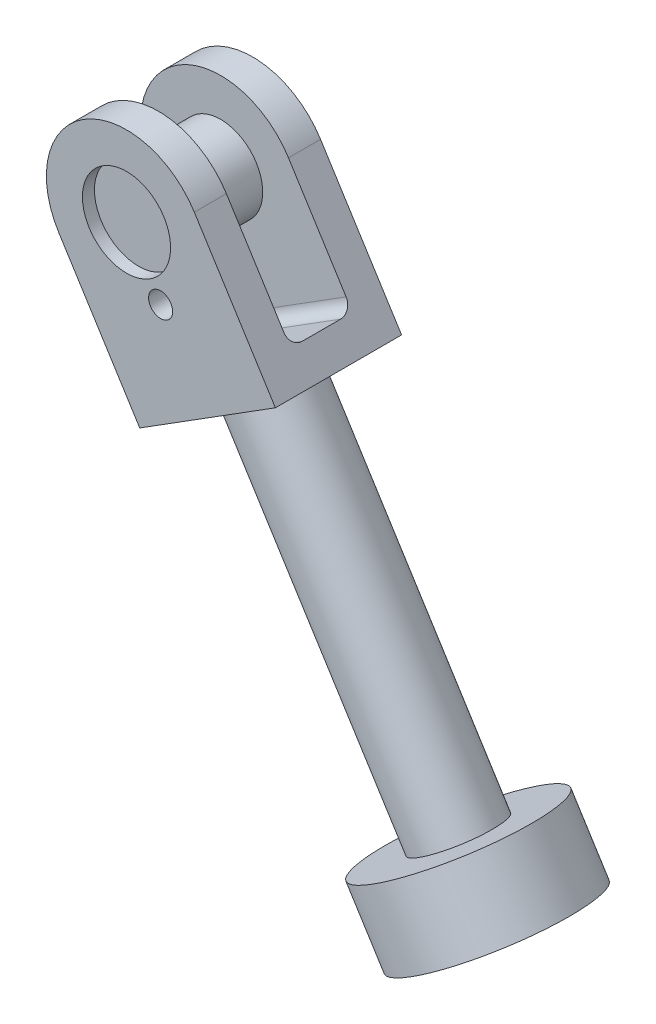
ISO-10303-21;
HEADER;
FILE_DESCRIPTION(('STEP AP214'),'2;1');
FILE_NAME('part.step','',(''),(''),'','','');
FILE_SCHEMA(('AUTOMOTIVE_DESIGN { 1 0 10303 214 1 1 1 1 }'));
ENDSEC;
DATA;
#1=APPLICATION_CONTEXT('core data for automotive mechanical design processes');
#2=APPLICATION_PROTOCOL_DEFINITION('international standard','automotive_design',2000,#1);
#3=PRODUCT_CONTEXT('',#1,'mechanical');
#4=PRODUCT('Part','Part','',(#3));
#5=PRODUCT_RELATED_PRODUCT_CATEGORY('part','',(#4));
#6=PRODUCT_DEFINITION_FORMATION('','',#4);
#7=PRODUCT_DEFINITION_CONTEXT('part definition',#1,'design');
#8=PRODUCT_DEFINITION('design','',#6,#7);
#9=PRODUCT_DEFINITION_SHAPE('','',#8);
#10=(LENGTH_UNIT() NAMED_UNIT(*) SI_UNIT(.MILLI.,.METRE.));
#11=(NAMED_UNIT(*) PLANE_ANGLE_UNIT() SI_UNIT($,.RADIAN.));
#12=(NAMED_UNIT(*) SI_UNIT($,.STERADIAN.) SOLID_ANGLE_UNIT());
#13=UNCERTAINTY_MEASURE_WITH_UNIT(LENGTH_MEASURE(1.E-05),#10,'distance_accuracy_value','');
#14=(GEOMETRIC_REPRESENTATION_CONTEXT(3) GLOBAL_UNCERTAINTY_ASSIGNED_CONTEXT((#13)) GLOBAL_UNIT_ASSIGNED_CONTEXT((#10,
#11,#12)) REPRESENTATION_CONTEXT('',''));
#15=CARTESIAN_POINT('',(0.,0.,0.));
#16=DIRECTION('',(0.,0.,1.));
#17=DIRECTION('',(1.,0.,0.));
#18=AXIS2_PLACEMENT_3D('',#15,#16,#17);
#19=CARTESIAN_POINT('',(-86.,190.5,21.5));
#20=DIRECTION('',(0.,0.,-1.));
#21=DIRECTION('',(-1.,0.,0.));
#22=AXIS2_PLACEMENT_3D('',#19,#20,#21);
#23=CYLINDRICAL_SURFACE('',#22,11.);
#24=CARTESIAN_POINT('',(-86.,190.5,15.75));
#25=DIRECTION('',(0.,0.,1.));
#26=DIRECTION('',(1.,0.,0.));
#27=AXIS2_PLACEMENT_3D('',#24,#25,#26);
#28=CIRCLE('',#27,11.);
#29=CARTESIAN_POINT('',(-97.,190.5,15.75));
#30=VERTEX_POINT('',#29);
#31=EDGE_CURVE('E318',#30,#30,#28,.T.);
#32=CARTESIAN_POINT('',(-86.,190.5,12.75));
#33=DIRECTION('',(0.,0.,-1.));
#34=DIRECTION('',(-1.,0.,0.));
#35=AXIS2_PLACEMENT_3D('',#32,#33,#34);
#36=CIRCLE('',#35,11.);
#37=CARTESIAN_POINT('',(-97.,190.5,12.75));
#38=VERTEX_POINT('',#37);
#39=EDGE_CURVE('E11',#38,#38,#36,.F.);
#40=CARTESIAN_POINT('',(-97.,190.5,15.75));
#41=CARTESIAN_POINT('',(-97.,190.5,15.71875));
#42=CARTESIAN_POINT('',(-97.,190.5,15.6875));
#43=CARTESIAN_POINT('',(-97.,190.5,15.625));
#44=CARTESIAN_POINT('',(-97.,190.5,15.59375));
#45=CARTESIAN_POINT('',(-97.,190.5,15.53125));
#46=CARTESIAN_POINT('',(-97.,190.5,15.5));
#47=CARTESIAN_POINT('',(-97.,190.5,15.4375));
#48=CARTESIAN_POINT('',(-97.,190.5,15.40625));
#49=CARTESIAN_POINT('',(-97.,190.5,15.34375));
#50=CARTESIAN_POINT('',(-97.,190.5,15.3125));
#51=CARTESIAN_POINT('',(-97.,190.5,15.25));
#52=CARTESIAN_POINT('',(-97.,190.5,15.21875));
#53=CARTESIAN_POINT('',(-97.,190.5,15.15625));
#54=CARTESIAN_POINT('',(-97.,190.5,15.125));
#55=CARTESIAN_POINT('',(-97.,190.5,15.0625));
#56=CARTESIAN_POINT('',(-97.,190.5,15.03125));
#57=CARTESIAN_POINT('',(-97.,190.5,14.96875));
#58=CARTESIAN_POINT('',(-97.,190.5,14.9375));
#59=CARTESIAN_POINT('',(-97.,190.5,14.875));
#60=CARTESIAN_POINT('',(-97.,190.5,14.84375));
#61=CARTESIAN_POINT('',(-97.,190.5,14.78125));
#62=CARTESIAN_POINT('',(-97.,190.5,14.75));
#63=CARTESIAN_POINT('',(-97.,190.5,14.6875));
#64=CARTESIAN_POINT('',(-97.,190.5,14.65625));
#65=CARTESIAN_POINT('',(-97.,190.5,14.59375));
#66=CARTESIAN_POINT('',(-97.,190.5,14.5625));
#67=CARTESIAN_POINT('',(-97.,190.5,14.5));
#68=CARTESIAN_POINT('',(-97.,190.5,14.46875));
#69=CARTESIAN_POINT('',(-97.,190.5,14.40625));
#70=CARTESIAN_POINT('',(-97.,190.5,14.375));
#71=CARTESIAN_POINT('',(-97.,190.5,14.3125));
#72=CARTESIAN_POINT('',(-97.,190.5,14.28125));
#73=CARTESIAN_POINT('',(-97.,190.5,14.21875));
#74=CARTESIAN_POINT('',(-97.,190.5,14.1875));
#75=CARTESIAN_POINT('',(-97.,190.5,14.125));
#76=CARTESIAN_POINT('',(-97.,190.5,14.09375));
#77=CARTESIAN_POINT('',(-97.,190.5,14.03125));
#78=CARTESIAN_POINT('',(-97.,190.5,14.));
#79=CARTESIAN_POINT('',(-97.,190.5,13.9375));
#80=CARTESIAN_POINT('',(-97.,190.5,13.90625));
#81=CARTESIAN_POINT('',(-97.,190.5,13.84375));
#82=CARTESIAN_POINT('',(-97.,190.5,13.8125));
#83=CARTESIAN_POINT('',(-97.,190.5,13.75));
#84=CARTESIAN_POINT('',(-97.,190.5,13.71875));
#85=CARTESIAN_POINT('',(-97.,190.5,13.65625));
#86=CARTESIAN_POINT('',(-97.,190.5,13.625));
#87=CARTESIAN_POINT('',(-97.,190.5,13.5625));
#88=CARTESIAN_POINT('',(-97.,190.5,13.53125));
#89=CARTESIAN_POINT('',(-97.,190.5,13.46875));
#90=CARTESIAN_POINT('',(-97.,190.5,13.4375));
#91=CARTESIAN_POINT('',(-97.,190.5,13.375));
#92=CARTESIAN_POINT('',(-97.,190.5,13.34375));
#93=CARTESIAN_POINT('',(-97.,190.5,13.28125));
#94=CARTESIAN_POINT('',(-97.,190.5,13.25));
#95=CARTESIAN_POINT('',(-97.,190.5,13.1875));
#96=CARTESIAN_POINT('',(-97.,190.5,13.15625));
#97=CARTESIAN_POINT('',(-97.,190.5,13.09375));
#98=CARTESIAN_POINT('',(-97.,190.5,13.0625));
#99=CARTESIAN_POINT('',(-97.,190.5,13.));
#100=CARTESIAN_POINT('',(-97.,190.5,12.96875));
#101=CARTESIAN_POINT('',(-97.,190.5,12.90625));
#102=CARTESIAN_POINT('',(-97.,190.5,12.875));
#103=CARTESIAN_POINT('',(-97.,190.5,12.8125));
#104=CARTESIAN_POINT('',(-97.,190.5,12.78125));
#105=CARTESIAN_POINT('',(-97.,190.5,12.75));
#106=B_SPLINE_CURVE_WITH_KNOTS('',3,(#40,#41,#42,#43,#44,#45,#46,#47,#48,#49,#50,#51,#52,#53,
#54,#55,#56,#57,#58,#59,#60,#61,#62,#63,#64,#65,#66,#67,#68,#69,#70,#71,#72,#73,#74,#75,#76,#77,
#78,#79,#80,#81,#82,#83,#84,#85,#86,#87,#88,#89,#90,#91,#92,#93,#94,#95,#96,#97,#98,#99,#100,
#101,#102,#103,#104,#105),.UNSPECIFIED.,.F.,.F.,(4,2,2,2,2,2,2,2,2,2,2,2,2,2,2,2,2,2,2,2,2,2,2,
2,2,2,2,2,2,2,2,2,4),(0.,0.0937500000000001,0.1875,0.281249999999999,0.374999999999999,
0.468749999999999,0.562499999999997,0.656249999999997,0.749999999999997,0.843749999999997,
0.937499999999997,1.03125,1.125,1.21875,1.3125,1.40625,1.5,1.59375,1.6875,1.78125,1.875,1.96875,
2.06249999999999,2.15625,2.25,2.34375,2.4375,2.53124999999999,2.62499999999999,2.71874999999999,
2.81249999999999,2.90624999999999,2.99999999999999),.UNSPECIFIED.);
#107=EDGE_CURVE('BSEAM36',#30,#38,#106,.T.);
#108=ORIENTED_EDGE('',*,*,#31,.T.);
#109=ORIENTED_EDGE('',*,*,#39,.F.);
#110=ORIENTED_EDGE('',*,*,#107,.T.);
#111=ORIENTED_EDGE('',*,*,#107,.F.);
#112=EDGE_LOOP('',(#108,#110,#109,#111));
#113=FACE_BOUND('',#112,.T.);
#114=ADVANCED_FACE('F36',(#113),#23,.F.);
#115=CARTESIAN_POINT('',(-86.,190.5,-15.75));
#116=DIRECTION('',(0.,0.,-1.));
#117=DIRECTION('',(-1.,0.,0.));
#118=AXIS2_PLACEMENT_3D('',#115,#116,#117);
#119=CIRCLE('',#118,11.);
#120=CARTESIAN_POINT('',(-97.,190.5,-15.75));
#121=VERTEX_POINT('',#120);
#122=EDGE_CURVE('E155',#121,#121,#119,.T.);
#123=CARTESIAN_POINT('',(-86.,190.5,-12.75));
#124=DIRECTION('',(0.,0.,1.));
#125=DIRECTION('',(1.,0.,0.));
#126=AXIS2_PLACEMENT_3D('',#123,#124,#125);
#127=CIRCLE('',#126,11.);
#128=CARTESIAN_POINT('',(-97.,190.5,-12.75));
#129=VERTEX_POINT('',#128);
#130=EDGE_CURVE('E44',#129,#129,#127,.F.);
#131=CARTESIAN_POINT('',(-97.,190.5,-15.75));
#132=CARTESIAN_POINT('',(-97.,190.5,-15.71875));
#133=CARTESIAN_POINT('',(-97.,190.5,-15.6875));
#134=CARTESIAN_POINT('',(-97.,190.5,-15.625));
#135=CARTESIAN_POINT('',(-97.,190.5,-15.59375));
#136=CARTESIAN_POINT('',(-97.,190.5,-15.53125));
#137=CARTESIAN_POINT('',(-97.,190.5,-15.5));
#138=CARTESIAN_POINT('',(-97.,190.5,-15.4375));
#139=CARTESIAN_POINT('',(-97.,190.5,-15.40625));
#140=CARTESIAN_POINT('',(-97.,190.5,-15.34375));
#141=CARTESIAN_POINT('',(-97.,190.5,-15.3125));
#142=CARTESIAN_POINT('',(-97.,190.5,-15.25));
#143=CARTESIAN_POINT('',(-97.,190.5,-15.21875));
#144=CARTESIAN_POINT('',(-97.,190.5,-15.15625));
#145=CARTESIAN_POINT('',(-97.,190.5,-15.125));
#146=CARTESIAN_POINT('',(-97.,190.5,-15.0625));
#147=CARTESIAN_POINT('',(-97.,190.5,-15.03125));
#148=CARTESIAN_POINT('',(-97.,190.5,-14.96875));
#149=CARTESIAN_POINT('',(-97.,190.5,-14.9375));
#150=CARTESIAN_POINT('',(-97.,190.5,-14.875));
#151=CARTESIAN_POINT('',(-97.,190.5,-14.84375));
#152=CARTESIAN_POINT('',(-97.,190.5,-14.78125));
#153=CARTESIAN_POINT('',(-97.,190.5,-14.75));
#154=CARTESIAN_POINT('',(-97.,190.5,-14.6875));
#155=CARTESIAN_POINT('',(-97.,190.5,-14.65625));
#156=CARTESIAN_POINT('',(-97.,190.5,-14.59375));
#157=CARTESIAN_POINT('',(-97.,190.5,-14.5625));
#158=CARTESIAN_POINT('',(-97.,190.5,-14.5));
#159=CARTESIAN_POINT('',(-97.,190.5,-14.46875));
#160=CARTESIAN_POINT('',(-97.,190.5,-14.40625));
#161=CARTESIAN_POINT('',(-97.,190.5,-14.375));
#162=CARTESIAN_POINT('',(-97.,190.5,-14.3125));
#163=CARTESIAN_POINT('',(-97.,190.5,-14.28125));
#164=CARTESIAN_POINT('',(-97.,190.5,-14.21875));
#165=CARTESIAN_POINT('',(-97.,190.5,-14.1875));
#166=CARTESIAN_POINT('',(-97.,190.5,-14.125));
#167=CARTESIAN_POINT('',(-97.,190.5,-14.09375));
#168=CARTESIAN_POINT('',(-97.,190.5,-14.03125));
#169=CARTESIAN_POINT('',(-97.,190.5,-14.));
#170=CARTESIAN_POINT('',(-97.,190.5,-13.9375));
#171=CARTESIAN_POINT('',(-97.,190.5,-13.90625));
#172=CARTESIAN_POINT('',(-97.,190.5,-13.84375));
#173=CARTESIAN_POINT('',(-97.,190.5,-13.8125));
#174=CARTESIAN_POINT('',(-97.,190.5,-13.75));
#175=CARTESIAN_POINT('',(-97.,190.5,-13.71875));
#176=CARTESIAN_POINT('',(-97.,190.5,-13.65625));
#177=CARTESIAN_POINT('',(-97.,190.5,-13.625));
#178=CARTESIAN_POINT('',(-97.,190.5,-13.5625));
#179=CARTESIAN_POINT('',(-97.,190.5,-13.53125));
#180=CARTESIAN_POINT('',(-97.,190.5,-13.46875));
#181=CARTESIAN_POINT('',(-97.,190.5,-13.4375));
#182=CARTESIAN_POINT('',(-97.,190.5,-13.375));
#183=CARTESIAN_POINT('',(-97.,190.5,-13.34375));
#184=CARTESIAN_POINT('',(-97.,190.5,-13.28125));
#185=CARTESIAN_POINT('',(-97.,190.5,-13.25));
#186=CARTESIAN_POINT('',(-97.,190.5,-13.1875));
#187=CARTESIAN_POINT('',(-97.,190.5,-13.15625));
#188=CARTESIAN_POINT('',(-97.,190.5,-13.09375));
#189=CARTESIAN_POINT('',(-97.,190.5,-13.0625));
#190=CARTESIAN_POINT('',(-97.,190.5,-13.));
#191=CARTESIAN_POINT('',(-97.,190.5,-12.96875));
#192=CARTESIAN_POINT('',(-97.,190.5,-12.90625));
#193=CARTESIAN_POINT('',(-97.,190.5,-12.875));
#194=CARTESIAN_POINT('',(-97.,190.5,-12.8125));
#195=CARTESIAN_POINT('',(-97.,190.5,-12.78125));
#196=CARTESIAN_POINT('',(-97.,190.5,-12.75));
#197=B_SPLINE_CURVE_WITH_KNOTS('',3,(#131,#132,#133,#134,#135,#136,#137,#138,#139,#140,#141,
#142,#143,#144,#145,#146,#147,#148,#149,#150,#151,#152,#153,#154,#155,#156,#157,#158,#159,#160,
#161,#162,#163,#164,#165,#166,#167,#168,#169,#170,#171,#172,#173,#174,#175,#176,#177,#178,#179,
#180,#181,#182,#183,#184,#185,#186,#187,#188,#189,#190,#191,#192,#193,#194,#195,#196),
.UNSPECIFIED.,.F.,.F.,(4,2,2,2,2,2,2,2,2,2,2,2,2,2,2,2,2,2,2,2,2,2,2,2,2,2,2,2,2,2,2,2,4),(0.,
0.0937499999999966,0.1875,0.281249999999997,0.375,0.468749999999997,0.5625,0.656249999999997,
0.750000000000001,0.843749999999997,0.937499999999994,1.03125,1.12499999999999,1.21875,
1.31249999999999,1.40625,1.49999999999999,1.59374999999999,1.68749999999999,1.78124999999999,
1.87499999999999,1.96874999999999,2.06249999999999,2.15624999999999,2.24999999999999,
2.34374999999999,2.43749999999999,2.53124999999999,2.62499999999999,2.71874999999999,
2.81249999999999,2.90624999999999,2.99999999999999),.UNSPECIFIED.);
#198=EDGE_CURVE('BSEAM214',#121,#129,#197,.T.);
#199=ORIENTED_EDGE('',*,*,#122,.T.);
#200=ORIENTED_EDGE('',*,*,#130,.F.);
#201=ORIENTED_EDGE('',*,*,#198,.T.);
#202=ORIENTED_EDGE('',*,*,#198,.F.);
#203=EDGE_LOOP('',(#199,#201,#200,#202));
#204=FACE_BOUND('',#203,.T.);
#205=ADVANCED_FACE('F214',(#204),#23,.F.);
#206=CARTESIAN_POINT('',(-18.9268808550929,83.8360572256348,0.));
#207=DIRECTION('',(0.532326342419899,-0.846539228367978,0.));
#208=DIRECTION('',(0.846539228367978,0.532326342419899,0.));
#209=AXIS2_PLACEMENT_3D('',#206,#207,#208);
#210=CYLINDRICAL_SURFACE('',#209,21.5);
#211=CARTESIAN_POINT('',(-18.9268808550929,83.8360572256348,0.));
#212=DIRECTION('',(0.532326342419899,-0.846539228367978,0.));
#213=DIRECTION('',(0.846539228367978,0.532326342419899,0.));
#214=AXIS2_PLACEMENT_3D('',#211,#212,#213);
#215=CIRCLE('',#214,21.5);
#216=CARTESIAN_POINT('',(-0.726287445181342,95.2810735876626,0.));
#217=VERTEX_POINT('',#216);
#218=EDGE_CURVE('E189',#217,#217,#215,.T.);
#219=ORIENTED_EDGE('',*,*,#218,.T.);
#220=EDGE_LOOP('',(#219));
#221=FACE_BOUND('',#220,.T.);
#222=CARTESIAN_POINT('',(-9.3450066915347,68.5983511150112,0.));
#223=DIRECTION('',(0.532326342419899,-0.846539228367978,0.));
#224=DIRECTION('',(0.846539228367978,0.532326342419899,0.));
#225=AXIS2_PLACEMENT_3D('',#222,#223,#224);
#226=CIRCLE('',#225,21.5);
#227=CARTESIAN_POINT('',(8.85558671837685,80.043367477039,0.));
#228=VERTEX_POINT('',#227);
#229=EDGE_CURVE('E186',#228,#228,#226,.T.);
#230=ORIENTED_EDGE('',*,*,#229,.F.);
#231=EDGE_LOOP('',(#230));
#232=FACE_BOUND('',#231,.T.);
#233=ADVANCED_FACE('F216',(#221,#232),#210,.T.);
#234=CARTESIAN_POINT('',(-18.9268808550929,83.8360572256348,0.));
#235=DIRECTION('',(0.532326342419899,-0.846539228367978,0.));
#236=DIRECTION('',(0.846539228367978,0.532326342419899,0.));
#237=AXIS2_PLACEMENT_3D('',#234,#235,#236);
#238=PLANE('',#237);
#239=CARTESIAN_POINT('',(-18.9268808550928,83.8360572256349,0.));
#240=DIRECTION('',(0.532326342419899,-0.846539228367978,0.));
#241=DIRECTION('',(0.846539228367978,0.532326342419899,0.));
#242=AXIS2_PLACEMENT_3D('',#239,#240,#241);
#243=CIRCLE('',#242,10.);
#244=CARTESIAN_POINT('',(-10.461488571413,89.1593206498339,0.));
#245=VERTEX_POINT('',#244);
#246=EDGE_CURVE('E192',#245,#245,#243,.F.);
#247=ORIENTED_EDGE('',*,*,#246,.F.);
#248=EDGE_LOOP('',(#247));
#249=FACE_BOUND('',#248,.T.);
#250=ORIENTED_EDGE('',*,*,#218,.F.);
#251=EDGE_LOOP('',(#250));
#252=FACE_BOUND('',#251,.T.);
#253=ADVANCED_FACE('F223',(#249,#252),#238,.F.);
#254=CARTESIAN_POINT('',(-9.3450066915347,68.5983511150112,0.));
#255=DIRECTION('',(0.532326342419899,-0.846539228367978,0.));
#256=DIRECTION('',(0.846539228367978,0.532326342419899,0.));
#257=AXIS2_PLACEMENT_3D('',#254,#255,#256);
#258=PLANE('',#257);
#259=ORIENTED_EDGE('',*,*,#229,.T.);
#260=EDGE_LOOP('',(#259));
#261=FACE_BOUND('',#260,.T.);
#262=ADVANCED_FACE('F236',(#261),#258,.T.);
#263=CARTESIAN_POINT('',(-12.538964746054,73.6775864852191,0.));
#264=DIRECTION('',(-0.532326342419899,0.846539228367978,0.));
#265=DIRECTION('',(-0.846539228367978,-0.532326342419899,0.));
#266=AXIS2_PLACEMENT_3D('',#263,#264,#265);
#267=CYLINDRICAL_SURFACE('',#266,10.);
#268=CARTESIAN_POINT('',(-65.7715989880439,158.331509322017,0.));
#269=DIRECTION('',(0.532326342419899,-0.846539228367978,0.));
#270=DIRECTION('',(0.846539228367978,0.532326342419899,0.));
#271=AXIS2_PLACEMENT_3D('',#268,#269,#270);
#272=CIRCLE('',#271,10.);
#273=CARTESIAN_POINT('',(-57.3062067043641,163.654772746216,0.));
#274=VERTEX_POINT('',#273);
#275=EDGE_CURVE('E148',#274,#274,#272,.T.);
#276=ORIENTED_EDGE('',*,*,#275,.T.);
#277=EDGE_LOOP('',(#276));
#278=FACE_BOUND('',#277,.T.);
#279=ORIENTED_EDGE('',*,*,#246,.T.);
#280=EDGE_LOOP('',(#279));
#281=FACE_BOUND('',#280,.T.);
#282=ADVANCED_FACE('F232',(#278,#281),#267,.T.);
#283=CARTESIAN_POINT('',(-86.,190.5,-15.75));
#284=DIRECTION('',(0.,0.,1.));
#285=DIRECTION('',(1.,0.,0.));
#286=AXIS2_PLACEMENT_3D('',#283,#284,#285);
#287=CYLINDRICAL_SURFACE('',#286,20.);
#288=CARTESIAN_POINT('',(-86.,190.5,-7.75));
#289=DIRECTION('',(0.,0.,-1.));
#290=DIRECTION('',(-1.,0.,0.));
#291=AXIS2_PLACEMENT_3D('',#288,#289,#290);
#292=CIRCLE('',#291,20.);
#293=CARTESIAN_POINT('',(-102.93078456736,179.853473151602,-7.75));
#294=VERTEX_POINT('',#293);
#295=CARTESIAN_POINT('',(-69.0692154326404,201.146526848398,-7.75));
#296=VERTEX_POINT('',#295);
#297=EDGE_CURVE('E178',#294,#296,#292,.T.);
#298=ORIENTED_EDGE('',*,*,#297,.T.);
#299=DIRECTION('',(0.,0.,1.));
#300=VECTOR('',#299,1.);
#301=CARTESIAN_POINT('',(-69.0692154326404,201.146526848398,-15.75));
#302=LINE('',#301,#300);
#303=CARTESIAN_POINT('',(-69.0692154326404,201.146526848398,-15.75));
#304=VERTEX_POINT('',#303);
#305=EDGE_CURVE('E176',#304,#296,#302,.T.);
#306=ORIENTED_EDGE('',*,*,#305,.F.);
#307=CARTESIAN_POINT('',(-86.,190.5,-15.75));
#308=DIRECTION('',(0.,0.,-1.));
#309=DIRECTION('',(-1.,0.,0.));
#310=AXIS2_PLACEMENT_3D('',#307,#308,#309);
#311=CIRCLE('',#310,20.);
#312=CARTESIAN_POINT('',(-102.93078456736,179.853473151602,-15.75));
#313=VERTEX_POINT('',#312);
#314=EDGE_CURVE('E171',#313,#304,#311,.T.);
#315=ORIENTED_EDGE('',*,*,#314,.F.);
#316=DIRECTION('',(0.,0.,1.));
#317=VECTOR('',#316,1.);
#318=CARTESIAN_POINT('',(-102.93078456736,179.853473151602,-15.75));
#319=LINE('',#318,#317);
#320=EDGE_CURVE('E183',#313,#294,#319,.T.);
#321=ORIENTED_EDGE('',*,*,#320,.T.);
#322=EDGE_LOOP('',(#298,#306,#315,#321));
#323=FACE_BOUND('',#322,.T.);
#324=ADVANCED_FACE('F235',(#323),#287,.T.);
#325=CARTESIAN_POINT('',(-86.,190.5,15.75));
#326=DIRECTION('',(0.,0.,-1.));
#327=DIRECTION('',(-1.,0.,0.));
#328=AXIS2_PLACEMENT_3D('',#325,#326,#327);
#329=CYLINDRICAL_SURFACE('',#328,20.);
#330=CARTESIAN_POINT('',(-86.,190.5,7.75));
#331=DIRECTION('',(0.,0.,1.));
#332=DIRECTION('',(1.,0.,0.));
#333=AXIS2_PLACEMENT_3D('',#330,#331,#332);
#334=CIRCLE('',#333,20.);
#335=CARTESIAN_POINT('',(-69.0692154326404,201.146526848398,7.75));
#336=VERTEX_POINT('',#335);
#337=CARTESIAN_POINT('',(-102.93078456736,179.853473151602,7.75));
#338=VERTEX_POINT('',#337);
#339=EDGE_CURVE('E161',#336,#338,#334,.T.);
#340=ORIENTED_EDGE('',*,*,#339,.T.);
#341=DIRECTION('',(0.,0.,-1.));
#342=VECTOR('',#341,1.);
#343=CARTESIAN_POINT('',(-102.93078456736,179.853473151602,15.75));
#344=LINE('',#343,#342);
#345=CARTESIAN_POINT('',(-102.93078456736,179.853473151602,15.75));
#346=VERTEX_POINT('',#345);
#347=EDGE_CURVE('E159',#346,#338,#344,.T.);
#348=ORIENTED_EDGE('',*,*,#347,.F.);
#349=CARTESIAN_POINT('',(-86.,190.5,15.75));
#350=DIRECTION('',(0.,0.,1.));
#351=DIRECTION('',(1.,0.,0.));
#352=AXIS2_PLACEMENT_3D('',#349,#350,#351);
#353=CIRCLE('',#352,20.);
#354=CARTESIAN_POINT('',(-69.0692154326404,201.146526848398,15.75));
#355=VERTEX_POINT('',#354);
#356=EDGE_CURVE('E126',#355,#346,#353,.T.);
#357=ORIENTED_EDGE('',*,*,#356,.F.);
#358=DIRECTION('',(0.,0.,-1.));
#359=VECTOR('',#358,1.);
#360=CARTESIAN_POINT('',(-69.0692154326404,201.146526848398,15.75));
#361=LINE('',#360,#359);
#362=EDGE_CURVE('E123',#355,#336,#361,.T.);
#363=ORIENTED_EDGE('',*,*,#362,.T.);
#364=EDGE_LOOP('',(#340,#348,#357,#363));
#365=FACE_BOUND('',#364,.T.);
#366=ADVANCED_FACE('F253',(#365),#329,.T.);
#367=CARTESIAN_POINT('',(30.0521732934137,5.94644816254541,-15.75));
#368=DIRECTION('',(0.,0.,-1.));
#369=DIRECTION('',(-1.,0.,0.));
#370=AXIS2_PLACEMENT_3D('',#367,#368,#369);
#371=PLANE('',#370);
#372=ORIENTED_EDGE('',*,*,#122,.F.);
#373=EDGE_LOOP('',(#372));
#374=FACE_BOUND('',#373,.T.);
#375=DIRECTION('',(0.532326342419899,-0.846539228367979,0.));
#376=VECTOR('',#375,1.);
#377=CARTESIAN_POINT('',(46.9829578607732,16.5929750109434,-15.75));
#378=LINE('',#377,#376);
#379=CARTESIAN_POINT('',(-48.8408144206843,168.978036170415,-15.75));
#380=VERTEX_POINT('',#379);
#381=EDGE_CURVE('E174',#304,#380,#378,.T.);
#382=ORIENTED_EDGE('',*,*,#381,.T.);
#383=DIRECTION('',(0.846539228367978,0.532326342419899,0.));
#384=VECTOR('',#383,1.);
#385=CARTESIAN_POINT('',(-48.8408144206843,168.978036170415,-15.75));
#386=LINE('',#385,#384);
#387=CARTESIAN_POINT('',(-82.7023835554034,147.684982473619,-15.75));
#388=VERTEX_POINT('',#387);
#389=EDGE_CURVE('E142',#388,#380,#386,.T.);
#390=ORIENTED_EDGE('',*,*,#389,.F.);
#391=DIRECTION('',(-0.532326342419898,0.846539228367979,0.));
#392=VECTOR('',#391,1.);
#393=CARTESIAN_POINT('',(13.1213887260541,-4.70007868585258,-15.75));
#394=LINE('',#393,#392);
#395=EDGE_CURVE('E169',#388,#313,#394,.T.);
#396=ORIENTED_EDGE('',*,*,#395,.T.);
#397=ORIENTED_EDGE('',*,*,#314,.T.);
#398=EDGE_LOOP('',(#382,#390,#396,#397));
#399=FACE_BOUND('',#398,.T.);
#400=ADVANCED_FACE('F256',(#374,#399),#371,.T.);
#401=CARTESIAN_POINT('',(30.0521732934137,5.94644816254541,-7.75));
#402=DIRECTION('',(0.,0.,-1.));
#403=DIRECTION('',(-1.,0.,0.));
#404=AXIS2_PLACEMENT_3D('',#401,#402,#403);
#405=PLANE('',#404);
#406=DIRECTION('',(-0.532326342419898,0.846539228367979,0.));
#407=VECTOR('',#406,1.);
#408=CARTESIAN_POINT('',(13.1213887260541,-4.70007868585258,-7.75));
#409=LINE('',#408,#407);
#410=CARTESIAN_POINT('',(-88.5579733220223,156.996913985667,-7.75));
#411=VERTEX_POINT('',#410);
#412=EDGE_CURVE('E168',#411,#294,#409,.T.);
#413=ORIENTED_EDGE('',*,*,#412,.F.);
#414=DIRECTION('',(0.846539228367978,0.532326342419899,0.));
#415=VECTOR('',#414,1.);
#416=CARTESIAN_POINT('',(-54.6964041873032,178.289967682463,-7.75));
#417=LINE('',#416,#415);
#418=CARTESIAN_POINT('',(-54.6964041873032,178.289967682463,-7.75));
#419=VERTEX_POINT('',#418);
#420=EDGE_CURVE('E202',#411,#419,#417,.T.);
#421=ORIENTED_EDGE('',*,*,#420,.T.);
#422=DIRECTION('',(0.532326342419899,-0.846539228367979,0.));
#423=VECTOR('',#422,1.);
#424=CARTESIAN_POINT('',(46.9829578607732,16.5929750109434,-7.75));
#425=LINE('',#424,#423);
#426=EDGE_CURVE('E172',#296,#419,#425,.T.);
#427=ORIENTED_EDGE('',*,*,#426,.F.);
#428=ORIENTED_EDGE('',*,*,#297,.F.);
#429=EDGE_LOOP('',(#413,#421,#427,#428));
#430=FACE_BOUND('',#429,.T.);
#431=CARTESIAN_POINT('',(-86.,190.5,-7.75));
#432=DIRECTION('',(0.,0.,1.));
#433=DIRECTION('',(1.,0.,0.));
#434=AXIS2_PLACEMENT_3D('',#431,#432,#433);
#435=CIRCLE('',#434,10.5);
#436=CARTESIAN_POINT('',(-96.5,190.5,-7.75));
#437=VERTEX_POINT('',#436);
#438=EDGE_CURVE('E305',#437,#437,#435,.T.);
#439=ORIENTED_EDGE('',*,*,#438,.F.);
#440=EDGE_LOOP('',(#439));
#441=FACE_BOUND('',#440,.T.);
#442=ADVANCED_FACE('F260',(#430,#441),#405,.F.);
#443=CARTESIAN_POINT('',(46.9829578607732,16.5929750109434,-15.75));
#444=DIRECTION('',(-0.846539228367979,-0.532326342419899,0.));
#445=DIRECTION('',(0.532326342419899,-0.846539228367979,0.));
#446=AXIS2_PLACEMENT_3D('',#443,#444,#445);
#447=PLANE('',#446);
#448=ORIENTED_EDGE('',*,*,#426,.T.);
#449=CARTESIAN_POINT('',(-54.6964041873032,178.289967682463,-4.75));
#450=DIRECTION('',(-0.846539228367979,-0.532326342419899,0.));
#451=DIRECTION('',(0.532326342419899,-0.846539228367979,0.));
#452=AXIS2_PLACEMENT_3D('',#449,#450,#451);
#453=CIRCLE('',#452,3.);
#454=CARTESIAN_POINT('',(-53.0994251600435,175.750349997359,-4.75));
#455=VERTEX_POINT('',#454);
#456=EDGE_CURVE('E51',#419,#455,#453,.T.);
#457=ORIENTED_EDGE('',*,*,#456,.T.);
#458=DIRECTION('',(0.,0.,1.));
#459=VECTOR('',#458,1.);
#460=CARTESIAN_POINT('',(-53.0994251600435,175.750349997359,-15.75));
#461=LINE('',#460,#459);
#462=CARTESIAN_POINT('',(-53.0994251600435,175.750349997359,4.75));
#463=VERTEX_POINT('',#462);
#464=EDGE_CURVE('E145',#455,#463,#461,.T.);
#465=ORIENTED_EDGE('',*,*,#464,.T.);
#466=CARTESIAN_POINT('',(-54.6964041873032,178.289967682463,4.75));
#467=DIRECTION('',(-0.846539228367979,-0.532326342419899,0.));
#468=DIRECTION('',(0.532326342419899,-0.846539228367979,0.));
#469=AXIS2_PLACEMENT_3D('',#466,#467,#468);
#470=CIRCLE('',#469,3.);
#471=CARTESIAN_POINT('',(-54.6964041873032,178.289967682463,7.75));
#472=VERTEX_POINT('',#471);
#473=EDGE_CURVE('E206',#463,#472,#470,.T.);
#474=ORIENTED_EDGE('',*,*,#473,.T.);
#475=DIRECTION('',(-0.532326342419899,0.846539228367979,0.));
#476=VECTOR('',#475,1.);
#477=CARTESIAN_POINT('',(46.9829578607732,16.5929750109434,7.75));
#478=LINE('',#477,#476);
#479=EDGE_CURVE('E153',#472,#336,#478,.T.);
#480=ORIENTED_EDGE('',*,*,#479,.T.);
#481=ORIENTED_EDGE('',*,*,#362,.F.);
#482=DIRECTION('',(-0.532326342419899,0.846539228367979,0.));
#483=VECTOR('',#482,1.);
#484=CARTESIAN_POINT('',(46.9829578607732,16.5929750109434,15.75));
#485=LINE('',#484,#483);
#486=CARTESIAN_POINT('',(-48.8408144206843,168.978036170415,15.75));
#487=VERTEX_POINT('',#486);
#488=EDGE_CURVE('E115',#487,#355,#485,.T.);
#489=ORIENTED_EDGE('',*,*,#488,.F.);
#490=DIRECTION('',(0.,0.,1.));
#491=VECTOR('',#490,1.);
#492=CARTESIAN_POINT('',(-48.8408144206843,168.978036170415,-15.75));
#493=LINE('',#492,#491);
#494=EDGE_CURVE('E121',#380,#487,#493,.T.);
#495=ORIENTED_EDGE('',*,*,#494,.F.);
#496=ORIENTED_EDGE('',*,*,#381,.F.);
#497=ORIENTED_EDGE('',*,*,#305,.T.);
#498=EDGE_LOOP('',(#448,#457,#465,#474,#480,#481,#489,#495,#496,#497));
#499=FACE_BOUND('',#498,.T.);
#500=ADVANCED_FACE('F118',(#499),#447,.F.);
#501=CARTESIAN_POINT('',(13.1213887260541,-4.70007868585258,-15.75));
#502=DIRECTION('',(0.846539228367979,0.532326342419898,0.));
#503=DIRECTION('',(-0.532326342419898,0.846539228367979,0.));
#504=AXIS2_PLACEMENT_3D('',#501,#502,#503);
#505=PLANE('',#504);
#506=ORIENTED_EDGE('',*,*,#395,.F.);
#507=DIRECTION('',(0.,0.,-1.));
#508=VECTOR('',#507,1.);
#509=CARTESIAN_POINT('',(-82.7023835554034,147.684982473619,-15.75));
#510=LINE('',#509,#508);
#511=CARTESIAN_POINT('',(-82.7023835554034,147.684982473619,15.75));
#512=VERTEX_POINT('',#511);
#513=EDGE_CURVE('E137',#512,#388,#510,.T.);
#514=ORIENTED_EDGE('',*,*,#513,.F.);
#515=DIRECTION('',(0.532326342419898,-0.846539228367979,0.));
#516=VECTOR('',#515,1.);
#517=CARTESIAN_POINT('',(-102.93078456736,179.853473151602,15.75));
#518=LINE('',#517,#516);
#519=EDGE_CURVE('E133',#346,#512,#518,.T.);
#520=ORIENTED_EDGE('',*,*,#519,.F.);
#521=ORIENTED_EDGE('',*,*,#347,.T.);
#522=DIRECTION('',(0.532326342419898,-0.846539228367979,0.));
#523=VECTOR('',#522,1.);
#524=CARTESIAN_POINT('',(-102.93078456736,179.853473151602,7.75));
#525=LINE('',#524,#523);
#526=CARTESIAN_POINT('',(-88.5579733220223,156.996913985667,7.75));
#527=VERTEX_POINT('',#526);
#528=EDGE_CURVE('E127',#338,#527,#525,.T.);
#529=ORIENTED_EDGE('',*,*,#528,.T.);
#530=CARTESIAN_POINT('',(-88.5579733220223,156.996913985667,4.75));
#531=DIRECTION('',(0.846539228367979,0.532326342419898,0.));
#532=DIRECTION('',(-0.532326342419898,0.846539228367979,0.));
#533=AXIS2_PLACEMENT_3D('',#530,#531,#532);
#534=CIRCLE('',#533,3.);
#535=CARTESIAN_POINT('',(-86.9609942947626,154.457296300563,4.75));
#536=VERTEX_POINT('',#535);
#537=EDGE_CURVE('E204',#527,#536,#534,.T.);
#538=ORIENTED_EDGE('',*,*,#537,.T.);
#539=DIRECTION('',(0.,0.,-1.));
#540=VECTOR('',#539,1.);
#541=CARTESIAN_POINT('',(-86.9609942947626,154.457296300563,-15.75));
#542=LINE('',#541,#540);
#543=CARTESIAN_POINT('',(-86.9609942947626,154.457296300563,-4.75));
#544=VERTEX_POINT('',#543);
#545=EDGE_CURVE('E143',#536,#544,#542,.T.);
#546=ORIENTED_EDGE('',*,*,#545,.T.);
#547=CARTESIAN_POINT('',(-88.5579733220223,156.996913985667,-4.75));
#548=DIRECTION('',(0.846539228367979,0.532326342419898,0.));
#549=DIRECTION('',(-0.532326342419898,0.846539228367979,0.));
#550=AXIS2_PLACEMENT_3D('',#547,#548,#549);
#551=CIRCLE('',#550,3.);
#552=EDGE_CURVE('E59',#544,#411,#551,.T.);
#553=ORIENTED_EDGE('',*,*,#552,.T.);
#554=ORIENTED_EDGE('',*,*,#412,.T.);
#555=ORIENTED_EDGE('',*,*,#320,.F.);
#556=EDGE_LOOP('',(#506,#514,#520,#521,#529,#538,#546,#553,#554,#555));
#557=FACE_BOUND('',#556,.T.);
#558=ADVANCED_FACE('F248',(#557),#505,.F.);
#559=CARTESIAN_POINT('',(30.0521732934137,5.94644816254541,15.75));
#560=DIRECTION('',(0.,0.,1.));
#561=DIRECTION('',(1.,0.,0.));
#562=AXIS2_PLACEMENT_3D('',#559,#560,#561);
#563=PLANE('',#562);
#564=CARTESIAN_POINT('',(-77.4827785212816,176.955372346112,15.75));
#565=DIRECTION('',(0.,0.,1.));
#566=DIRECTION('',(1.,0.,0.));
#567=AXIS2_PLACEMENT_3D('',#564,#565,#566);
#568=CIRCLE('',#567,3.00000000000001);
#569=CARTESIAN_POINT('',(-74.4827785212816,176.955372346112,15.75));
#570=VERTEX_POINT('',#569);
#571=EDGE_CURVE('E311',#570,#570,#568,.T.);
#572=ORIENTED_EDGE('',*,*,#571,.F.);
#573=EDGE_LOOP('',(#572));
#574=FACE_BOUND('',#573,.T.);
#575=ORIENTED_EDGE('',*,*,#31,.F.);
#576=EDGE_LOOP('',(#575));
#577=FACE_BOUND('',#576,.T.);
#578=ORIENTED_EDGE('',*,*,#519,.T.);
#579=DIRECTION('',(-0.846539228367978,-0.532326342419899,0.));
#580=VECTOR('',#579,1.);
#581=CARTESIAN_POINT('',(-48.8408144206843,168.978036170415,15.75));
#582=LINE('',#581,#580);
#583=EDGE_CURVE('E130',#487,#512,#582,.T.);
#584=ORIENTED_EDGE('',*,*,#583,.F.);
#585=ORIENTED_EDGE('',*,*,#488,.T.);
#586=ORIENTED_EDGE('',*,*,#356,.T.);
#587=EDGE_LOOP('',(#578,#584,#585,#586));
#588=FACE_BOUND('',#587,.T.);
#589=ADVANCED_FACE('F131',(#574,#577,#588),#563,.T.);
#590=CARTESIAN_POINT('',(30.0521732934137,5.94644816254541,7.75));
#591=DIRECTION('',(0.,0.,1.));
#592=DIRECTION('',(1.,0.,0.));
#593=AXIS2_PLACEMENT_3D('',#590,#591,#592);
#594=PLANE('',#593);
#595=CARTESIAN_POINT('',(-77.4827785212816,176.955372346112,7.75));
#596=DIRECTION('',(0.,0.,1.));
#597=DIRECTION('',(1.,0.,0.));
#598=AXIS2_PLACEMENT_3D('',#595,#596,#597);
#599=CIRCLE('',#598,3.00000000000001);
#600=CARTESIAN_POINT('',(-74.4827785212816,176.955372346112,7.75));
#601=VERTEX_POINT('',#600);
#602=EDGE_CURVE('E307',#601,#601,#599,.F.);
#603=ORIENTED_EDGE('',*,*,#602,.F.);
#604=EDGE_LOOP('',(#603));
#605=FACE_BOUND('',#604,.T.);
#606=ORIENTED_EDGE('',*,*,#479,.F.);
#607=DIRECTION('',(-0.846539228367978,-0.532326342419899,0.));
#608=VECTOR('',#607,1.);
#609=CARTESIAN_POINT('',(-88.5579733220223,156.996913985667,7.75));
#610=LINE('',#609,#608);
#611=EDGE_CURVE('E195',#472,#527,#610,.T.);
#612=ORIENTED_EDGE('',*,*,#611,.T.);
#613=ORIENTED_EDGE('',*,*,#528,.F.);
#614=ORIENTED_EDGE('',*,*,#339,.F.);
#615=EDGE_LOOP('',(#606,#612,#613,#614));
#616=FACE_BOUND('',#615,.T.);
#617=CARTESIAN_POINT('',(-86.,190.5,7.75));
#618=DIRECTION('',(0.,0.,-1.));
#619=DIRECTION('',(-1.,0.,0.));
#620=AXIS2_PLACEMENT_3D('',#617,#618,#619);
#621=CIRCLE('',#620,10.5);
#622=CARTESIAN_POINT('',(-96.5,190.5,7.75));
#623=VERTEX_POINT('',#622);
#624=EDGE_CURVE('E308',#623,#623,#621,.T.);
#625=ORIENTED_EDGE('',*,*,#624,.F.);
#626=EDGE_LOOP('',(#625));
#627=FACE_BOUND('',#626,.T.);
#628=ADVANCED_FACE('F244',(#605,#616,#627),#594,.F.);
#629=CARTESIAN_POINT('',(-94.2461370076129,149.876205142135,0.));
#630=DIRECTION('',(0.532326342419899,-0.846539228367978,0.));
#631=DIRECTION('',(0.846539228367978,0.532326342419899,0.));
#632=AXIS2_PLACEMENT_3D('',#629,#630,#631);
#633=PLANE('',#632);
#634=ORIENTED_EDGE('',*,*,#545,.F.);
#635=DIRECTION('',(-0.846539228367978,-0.532326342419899,0.));
#636=VECTOR('',#635,1.);
#637=CARTESIAN_POINT('',(-53.0994251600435,175.750349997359,4.75));
#638=LINE('',#637,#636);
#639=EDGE_CURVE('E200',#536,#463,#638,.F.);
#640=ORIENTED_EDGE('',*,*,#639,.T.);
#641=ORIENTED_EDGE('',*,*,#464,.F.);
#642=DIRECTION('',(0.846539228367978,0.532326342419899,0.));
#643=VECTOR('',#642,1.);
#644=CARTESIAN_POINT('',(-86.9609942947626,154.457296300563,-4.75));
#645=LINE('',#644,#643);
#646=EDGE_CURVE('E198',#455,#544,#645,.F.);
#647=ORIENTED_EDGE('',*,*,#646,.T.);
#648=EDGE_LOOP('',(#634,#640,#641,#647));
#649=FACE_BOUND('',#648,.T.);
#650=ADVANCED_FACE('F240',(#649),#633,.F.);
#651=CARTESIAN_POINT('',(-89.9875262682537,143.103891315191,0.));
#652=DIRECTION('',(0.532326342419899,-0.846539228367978,0.));
#653=DIRECTION('',(0.846539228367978,0.532326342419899,0.));
#654=AXIS2_PLACEMENT_3D('',#651,#652,#653);
#655=PLANE('',#654);
#656=ORIENTED_EDGE('',*,*,#275,.F.);
#657=EDGE_LOOP('',(#656));
#658=FACE_BOUND('',#657,.T.);
#659=ORIENTED_EDGE('',*,*,#494,.T.);
#660=ORIENTED_EDGE('',*,*,#583,.T.);
#661=ORIENTED_EDGE('',*,*,#513,.T.);
#662=ORIENTED_EDGE('',*,*,#389,.T.);
#663=EDGE_LOOP('',(#659,#660,#661,#662));
#664=FACE_BOUND('',#663,.T.);
#665=ADVANCED_FACE('F140',(#658,#664),#655,.T.);
#666=CARTESIAN_POINT('',(-77.4827785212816,176.955372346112,-21.501));
#667=DIRECTION('',(0.,0.,1.));
#668=DIRECTION('',(1.,0.,0.));
#669=AXIS2_PLACEMENT_3D('',#666,#667,#668);
#670=CYLINDRICAL_SURFACE('',#669,3.00000000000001);
#671=ORIENTED_EDGE('',*,*,#571,.T.);
#672=EDGE_LOOP('',(#671));
#673=FACE_BOUND('',#672,.T.);
#674=ORIENTED_EDGE('',*,*,#602,.T.);
#675=EDGE_LOOP('',(#674));
#676=FACE_BOUND('',#675,.T.);
#677=ADVANCED_FACE('F230',(#673,#676),#670,.F.);
#678=CARTESIAN_POINT('',(-71.6271887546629,167.643440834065,4.75));
#679=DIRECTION('',(0.846539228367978,0.532326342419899,0.));
#680=DIRECTION('',(-0.532326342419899,0.846539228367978,0.));
#681=AXIS2_PLACEMENT_3D('',#678,#679,#680);
#682=CYLINDRICAL_SURFACE('',#681,3.);
#683=ORIENTED_EDGE('',*,*,#473,.F.);
#684=ORIENTED_EDGE('',*,*,#639,.F.);
#685=ORIENTED_EDGE('',*,*,#537,.F.);
#686=ORIENTED_EDGE('',*,*,#611,.F.);
#687=EDGE_LOOP('',(#683,#684,#685,#686));
#688=FACE_BOUND('',#687,.T.);
#689=ADVANCED_FACE('F277',(#688),#682,.F.);
#690=CARTESIAN_POINT('',(-71.6271887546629,167.643440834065,-4.75));
#691=DIRECTION('',(-0.846539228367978,-0.532326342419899,0.));
#692=DIRECTION('',(0.532326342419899,-0.846539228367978,0.));
#693=AXIS2_PLACEMENT_3D('',#690,#691,#692);
#694=CYLINDRICAL_SURFACE('',#693,3.);
#695=ORIENTED_EDGE('',*,*,#552,.F.);
#696=ORIENTED_EDGE('',*,*,#646,.F.);
#697=ORIENTED_EDGE('',*,*,#456,.F.);
#698=ORIENTED_EDGE('',*,*,#420,.F.);
#699=EDGE_LOOP('',(#695,#696,#697,#698));
#700=FACE_BOUND('',#699,.T.);
#701=ADVANCED_FACE('F38',(#700),#694,.F.);
#702=CARTESIAN_POINT('',(-86.,190.5,-12.75));
#703=DIRECTION('',(0.,0.,1.));
#704=DIRECTION('',(1.,0.,0.));
#705=AXIS2_PLACEMENT_3D('',#702,#703,#704);
#706=PLANE('',#705);
#707=ORIENTED_EDGE('',*,*,#130,.T.);
#708=EDGE_LOOP('',(#707));
#709=FACE_BOUND('',#708,.T.);
#710=ADVANCED_FACE('F212',(#709),#706,.F.);
#711=CARTESIAN_POINT('',(-86.,190.5,12.75));
#712=DIRECTION('',(0.,0.,-1.));
#713=DIRECTION('',(-1.,0.,0.));
#714=AXIS2_PLACEMENT_3D('',#711,#712,#713);
#715=PLANE('',#714);
#716=ORIENTED_EDGE('',*,*,#39,.T.);
#717=EDGE_LOOP('',(#716));
#718=FACE_BOUND('',#717,.T.);
#719=ADVANCED_FACE('F326',(#718),#715,.F.);
#720=CARTESIAN_POINT('',(-86.,190.5,42.448484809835));
#721=DIRECTION('',(0.,0.,-1.));
#722=DIRECTION('',(-1.,0.,0.));
#723=AXIS2_PLACEMENT_3D('',#720,#721,#722);
#724=CYLINDRICAL_SURFACE('',#723,10.5);
#725=CARTESIAN_POINT('',(-96.5,190.5,7.75));
#726=CARTESIAN_POINT('',(-96.5,190.5,7.58854166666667));
#727=CARTESIAN_POINT('',(-96.5,190.5,7.42708333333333));
#728=CARTESIAN_POINT('',(-96.5,190.5,7.10416666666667));
#729=CARTESIAN_POINT('',(-96.5,190.5,6.94270833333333));
#730=CARTESIAN_POINT('',(-96.5,190.5,6.61979166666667));
#731=CARTESIAN_POINT('',(-96.5,190.5,6.45833333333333));
#732=CARTESIAN_POINT('',(-96.5,190.5,6.13541666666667));
#733=CARTESIAN_POINT('',(-96.5,190.5,5.97395833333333));
#734=CARTESIAN_POINT('',(-96.5,190.5,5.65104166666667));
#735=CARTESIAN_POINT('',(-96.5,190.5,5.48958333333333));
#736=CARTESIAN_POINT('',(-96.5,190.5,5.16666666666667));
#737=CARTESIAN_POINT('',(-96.5,190.5,5.00520833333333));
#738=CARTESIAN_POINT('',(-96.5,190.5,4.68229166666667));
#739=CARTESIAN_POINT('',(-96.5,190.5,4.52083333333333));
#740=CARTESIAN_POINT('',(-96.5,190.5,4.19791666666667));
#741=CARTESIAN_POINT('',(-96.5,190.5,4.03645833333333));
#742=CARTESIAN_POINT('',(-96.5,190.5,3.71354166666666));
#743=CARTESIAN_POINT('',(-96.5,190.5,3.55208333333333));
#744=CARTESIAN_POINT('',(-96.5,190.5,3.22916666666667));
#745=CARTESIAN_POINT('',(-96.5,190.5,3.06770833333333));
#746=CARTESIAN_POINT('',(-96.5,190.5,2.74479166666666));
#747=CARTESIAN_POINT('',(-96.5,190.5,2.58333333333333));
#748=CARTESIAN_POINT('',(-96.5,190.5,2.26041666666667));
#749=CARTESIAN_POINT('',(-96.5,190.5,2.09895833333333));
#750=CARTESIAN_POINT('',(-96.5,190.5,1.77604166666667));
#751=CARTESIAN_POINT('',(-96.5,190.5,1.61458333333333));
#752=CARTESIAN_POINT('',(-96.5,190.5,1.29166666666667));
#753=CARTESIAN_POINT('',(-96.5,190.5,1.13020833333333));
#754=CARTESIAN_POINT('',(-96.5,190.5,0.807291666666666));
#755=CARTESIAN_POINT('',(-96.5,190.5,0.645833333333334));
#756=CARTESIAN_POINT('',(-96.5,190.5,0.322916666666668));
#757=CARTESIAN_POINT('',(-96.5,190.5,0.161458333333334));
#758=CARTESIAN_POINT('',(-96.5,190.5,-0.161458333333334));
#759=CARTESIAN_POINT('',(-96.5,190.5,-0.322916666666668));
#760=CARTESIAN_POINT('',(-96.5,190.5,-0.645833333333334));
#761=CARTESIAN_POINT('',(-96.5,190.5,-0.807291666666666));
#762=CARTESIAN_POINT('',(-96.5,190.5,-1.13020833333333));
#763=CARTESIAN_POINT('',(-96.5,190.5,-1.29166666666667));
#764=CARTESIAN_POINT('',(-96.5,190.5,-1.61458333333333));
#765=CARTESIAN_POINT('',(-96.5,190.5,-1.77604166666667));
#766=CARTESIAN_POINT('',(-96.5,190.5,-2.09895833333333));
#767=CARTESIAN_POINT('',(-96.5,190.5,-2.26041666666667));
#768=CARTESIAN_POINT('',(-96.5,190.5,-2.58333333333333));
#769=CARTESIAN_POINT('',(-96.5,190.5,-2.74479166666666));
#770=CARTESIAN_POINT('',(-96.5,190.5,-3.06770833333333));
#771=CARTESIAN_POINT('',(-96.5,190.5,-3.22916666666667));
#772=CARTESIAN_POINT('',(-96.5,190.5,-3.55208333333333));
#773=CARTESIAN_POINT('',(-96.5,190.5,-3.71354166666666));
#774=CARTESIAN_POINT('',(-96.5,190.5,-4.03645833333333));
#775=CARTESIAN_POINT('',(-96.5,190.5,-4.19791666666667));
#776=CARTESIAN_POINT('',(-96.5,190.5,-4.52083333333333));
#777=CARTESIAN_POINT('',(-96.5,190.5,-4.68229166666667));
#778=CARTESIAN_POINT('',(-96.5,190.5,-5.00520833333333));
#779=CARTESIAN_POINT('',(-96.5,190.5,-5.16666666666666));
#780=CARTESIAN_POINT('',(-96.5,190.5,-5.48958333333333));
#781=CARTESIAN_POINT('',(-96.5,190.5,-5.65104166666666));
#782=CARTESIAN_POINT('',(-96.5,190.5,-5.97395833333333));
#783=CARTESIAN_POINT('',(-96.5,190.5,-6.13541666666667));
#784=CARTESIAN_POINT('',(-96.5,190.5,-6.45833333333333));
#785=CARTESIAN_POINT('',(-96.5,190.5,-6.61979166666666));
#786=CARTESIAN_POINT('',(-96.5,190.5,-6.94270833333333));
#787=CARTESIAN_POINT('',(-96.5,190.5,-7.10416666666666));
#788=CARTESIAN_POINT('',(-96.5,190.5,-7.42708333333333));
#789=CARTESIAN_POINT('',(-96.5,190.5,-7.58854166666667));
#790=CARTESIAN_POINT('',(-96.5,190.5,-7.75));
#791=B_SPLINE_CURVE_WITH_KNOTS('',3,(#725,#726,#727,#728,#729,#730,#731,#732,#733,#734,#735,
#736,#737,#738,#739,#740,#741,#742,#743,#744,#745,#746,#747,#748,#749,#750,#751,#752,#753,#754,
#755,#756,#757,#758,#759,#760,#761,#762,#763,#764,#765,#766,#767,#768,#769,#770,#771,#772,#773,
#774,#775,#776,#777,#778,#779,#780,#781,#782,#783,#784,#785,#786,#787,#788,#789,#790),
.UNSPECIFIED.,.F.,.F.,(4,2,2,2,2,2,2,2,2,2,2,2,2,2,2,2,2,2,2,2,2,2,2,2,2,2,2,2,2,2,2,2,4),(0.,
0.484375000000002,0.968749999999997,1.453125,1.9375,2.421875,2.90625,3.390625,3.875,4.359375,
4.84375,5.328125,5.8125,6.296875,6.78125,7.265625,7.75,8.234375,8.71875,9.203125,9.6875,
10.171875,10.65625,11.140625,11.625,12.109375,12.59375,13.078125,13.5625,14.046875,14.53125,
15.015625,15.5),.UNSPECIFIED.);
#792=EDGE_CURVE('BSEAM328',#623,#437,#791,.T.);
#793=ORIENTED_EDGE('',*,*,#624,.T.);
#794=ORIENTED_EDGE('',*,*,#438,.T.);
#795=ORIENTED_EDGE('',*,*,#792,.T.);
#796=ORIENTED_EDGE('',*,*,#792,.F.);
#797=EDGE_LOOP('',(#793,#795,#794,#796));
#798=FACE_BOUND('',#797,.T.);
#799=ADVANCED_FACE('F328',(#798),#724,.T.);
#800=CLOSED_SHELL('',(#114,#205,#233,#253,#262,#282,#324,#366,#400,#442,#500,#558,#589,#628,
#650,#665,#677,#689,#701,#710,#719,#799));
#801=MANIFOLD_SOLID_BREP('B2',#800);
#802=ADVANCED_BREP_SHAPE_REPRESENTATION('',(#18,#801),#14);
#803=SHAPE_DEFINITION_REPRESENTATION(#9,#802);
ENDSEC;
END-ISO-10303-21;
